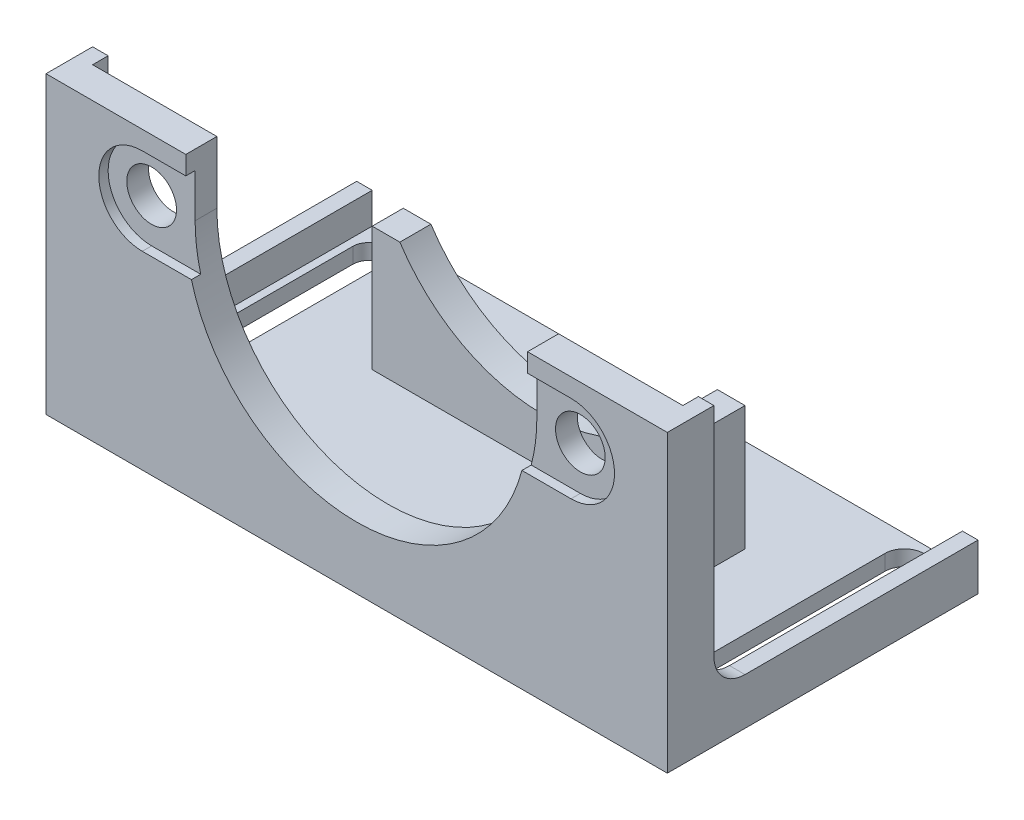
ISO-10303-21;
HEADER;
FILE_DESCRIPTION(('STEP AP214'),'2;1');
FILE_NAME('part.step','',(''),(''),'','','');
FILE_SCHEMA(('AUTOMOTIVE_DESIGN { 1 0 10303 214 1 1 1 1 }'));
ENDSEC;
DATA;
#1=APPLICATION_CONTEXT('core data for automotive mechanical design processes');
#2=APPLICATION_PROTOCOL_DEFINITION('international standard','automotive_design',2000,#1);
#3=PRODUCT_CONTEXT('',#1,'mechanical');
#4=PRODUCT('Part','Part','',(#3));
#5=PRODUCT_RELATED_PRODUCT_CATEGORY('part','',(#4));
#6=PRODUCT_DEFINITION_FORMATION('','',#4);
#7=PRODUCT_DEFINITION_CONTEXT('part definition',#1,'design');
#8=PRODUCT_DEFINITION('design','',#6,#7);
#9=PRODUCT_DEFINITION_SHAPE('','',#8);
#10=(LENGTH_UNIT() NAMED_UNIT(*) SI_UNIT(.MILLI.,.METRE.));
#11=(NAMED_UNIT(*) PLANE_ANGLE_UNIT() SI_UNIT($,.RADIAN.));
#12=(NAMED_UNIT(*) SI_UNIT($,.STERADIAN.) SOLID_ANGLE_UNIT());
#13=UNCERTAINTY_MEASURE_WITH_UNIT(LENGTH_MEASURE(1.E-05),#10,'distance_accuracy_value','');
#14=(GEOMETRIC_REPRESENTATION_CONTEXT(3) GLOBAL_UNCERTAINTY_ASSIGNED_CONTEXT((#13)) GLOBAL_UNIT_ASSIGNED_CONTEXT((#10,
#11,#12)) REPRESENTATION_CONTEXT('',''));
#15=CARTESIAN_POINT('',(0.,0.,0.));
#16=DIRECTION('',(0.,0.,1.));
#17=DIRECTION('',(1.,0.,0.));
#18=AXIS2_PLACEMENT_3D('',#15,#16,#17);
#19=CARTESIAN_POINT('',(0.,11.43,0.));
#20=DIRECTION('',(0.,1.,0.));
#21=DIRECTION('',(0.,0.,1.));
#22=AXIS2_PLACEMENT_3D('',#19,#20,#21);
#23=PLANE('',#22);
#24=DIRECTION('',(0.,0.,1.));
#25=VECTOR('',#24,1.);
#26=CARTESIAN_POINT('',(13.691178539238,11.43,0.));
#27=LINE('',#26,#25);
#28=CARTESIAN_POINT('',(13.691178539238,11.43,7.62));
#29=VERTEX_POINT('',#28);
#30=CARTESIAN_POINT('',(13.691178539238,11.43,10.16));
#31=VERTEX_POINT('',#30);
#32=EDGE_CURVE('E576',#29,#31,#27,.T.);
#33=ORIENTED_EDGE('',*,*,#32,.F.);
#34=DIRECTION('',(-1.,0.,0.));
#35=VECTOR('',#34,1.);
#36=CARTESIAN_POINT('',(11.43,11.43,7.62));
#37=LINE('',#36,#35);
#38=CARTESIAN_POINT('',(11.43,11.43,7.62));
#39=VERTEX_POINT('',#38);
#40=EDGE_CURVE('E398',#29,#39,#37,.T.);
#41=ORIENTED_EDGE('',*,*,#40,.T.);
#42=DIRECTION('',(0.,0.,1.));
#43=VECTOR('',#42,1.);
#44=CARTESIAN_POINT('',(11.43,11.43,7.62));
#45=LINE('',#44,#43);
#46=CARTESIAN_POINT('',(11.43,11.43,10.16));
#47=VERTEX_POINT('',#46);
#48=EDGE_CURVE('E388',#39,#47,#45,.T.);
#49=ORIENTED_EDGE('',*,*,#48,.T.);
#50=DIRECTION('',(1.,0.,0.));
#51=VECTOR('',#50,1.);
#52=CARTESIAN_POINT('',(11.43,11.43,10.16));
#53=LINE('',#52,#51);
#54=EDGE_CURVE('E393',#47,#31,#53,.T.);
#55=ORIENTED_EDGE('',*,*,#54,.T.);
#56=EDGE_LOOP('',(#33,#41,#49,#55));
#57=FACE_BOUND('',#56,.T.);
#58=ADVANCED_FACE('F36',(#57),#23,.T.);
#59=CARTESIAN_POINT('',(0.,1.27,25.4));
#60=DIRECTION('',(0.,1.,0.));
#61=DIRECTION('',(0.,0.,1.));
#62=AXIS2_PLACEMENT_3D('',#59,#60,#61);
#63=PLANE('',#62);
#64=CARTESIAN_POINT('',(3.175,1.27,2.2156355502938));
#65=DIRECTION('',(0.,1.,0.));
#66=DIRECTION('',(0.,0.,1.));
#67=AXIS2_PLACEMENT_3D('',#64,#65,#66);
#68=CIRCLE('',#67,1.27);
#69=CARTESIAN_POINT('',(4.445,1.27,2.2156355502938));
#70=VERTEX_POINT('',#69);
#71=CARTESIAN_POINT('',(1.905,1.27,2.2156355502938));
#72=VERTEX_POINT('',#71);
#73=EDGE_CURVE('E51',#70,#72,#68,.T.);
#74=ORIENTED_EDGE('',*,*,#73,.F.);
#75=DIRECTION('',(0.,0.,-1.));
#76=VECTOR('',#75,1.);
#77=CARTESIAN_POINT('',(4.445,1.27,2.2156355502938));
#78=LINE('',#77,#76);
#79=CARTESIAN_POINT('',(4.445,1.27,19.9956355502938));
#80=VERTEX_POINT('',#79);
#81=EDGE_CURVE('E313',#80,#70,#78,.T.);
#82=ORIENTED_EDGE('',*,*,#81,.F.);
#83=CARTESIAN_POINT('',(3.175,1.27,19.9956355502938));
#84=DIRECTION('',(0.,1.,0.));
#85=DIRECTION('',(0.,0.,1.));
#86=AXIS2_PLACEMENT_3D('',#83,#84,#85);
#87=CIRCLE('',#86,1.27);
#88=CARTESIAN_POINT('',(1.905,1.27,19.9956355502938));
#89=VERTEX_POINT('',#88);
#90=EDGE_CURVE('E316',#89,#80,#87,.T.);
#91=ORIENTED_EDGE('',*,*,#90,.F.);
#92=DIRECTION('',(0.,0.,1.));
#93=VECTOR('',#92,1.);
#94=CARTESIAN_POINT('',(1.905,1.27,2.2156355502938));
#95=LINE('',#94,#93);
#96=EDGE_CURVE('E322',#72,#89,#95,.T.);
#97=ORIENTED_EDGE('',*,*,#96,.F.);
#98=EDGE_LOOP('',(#74,#82,#91,#97));
#99=FACE_BOUND('',#98,.T.);
#100=CARTESIAN_POINT('',(46.99,1.27,2.2156355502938));
#101=DIRECTION('',(0.,1.,0.));
#102=DIRECTION('',(0.,0.,1.));
#103=AXIS2_PLACEMENT_3D('',#100,#101,#102);
#104=CIRCLE('',#103,1.5875);
#105=CARTESIAN_POINT('',(48.5775,1.27,2.2156355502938));
#106=VERTEX_POINT('',#105);
#107=CARTESIAN_POINT('',(45.4025,1.27,2.2156355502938));
#108=VERTEX_POINT('',#107);
#109=EDGE_CURVE('E59',#106,#108,#104,.T.);
#110=ORIENTED_EDGE('',*,*,#109,.F.);
#111=DIRECTION('',(0.,0.,-1.));
#112=VECTOR('',#111,1.);
#113=CARTESIAN_POINT('',(48.5775,1.27,2.2156355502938));
#114=LINE('',#113,#112);
#115=CARTESIAN_POINT('',(48.5775,1.27,19.9956355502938));
#116=VERTEX_POINT('',#115);
#117=EDGE_CURVE('E337',#116,#106,#114,.T.);
#118=ORIENTED_EDGE('',*,*,#117,.F.);
#119=CARTESIAN_POINT('',(46.99,1.27,19.9956355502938));
#120=DIRECTION('',(0.,1.,0.));
#121=DIRECTION('',(0.,0.,1.));
#122=AXIS2_PLACEMENT_3D('',#119,#120,#121);
#123=CIRCLE('',#122,1.5875);
#124=CARTESIAN_POINT('',(45.4025,1.27,19.9956355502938));
#125=VERTEX_POINT('',#124);
#126=EDGE_CURVE('E351',#125,#116,#123,.T.);
#127=ORIENTED_EDGE('',*,*,#126,.F.);
#128=DIRECTION('',(0.,0.,1.));
#129=VECTOR('',#128,1.);
#130=CARTESIAN_POINT('',(45.4025,1.27,2.2156355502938));
#131=LINE('',#130,#129);
#132=EDGE_CURVE('E348',#108,#125,#131,.T.);
#133=ORIENTED_EDGE('',*,*,#132,.F.);
#134=EDGE_LOOP('',(#110,#118,#127,#133));
#135=FACE_BOUND('',#134,.T.);
#136=DIRECTION('',(0.,0.,-1.));
#137=VECTOR('',#136,1.);
#138=CARTESIAN_POINT('',(1.27,1.27,-1.63768401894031));
#139=LINE('',#138,#137);
#140=CARTESIAN_POINT('',(1.27,1.27,22.86));
#141=VERTEX_POINT('',#140);
#142=CARTESIAN_POINT('',(1.27,1.27,0.));
#143=VERTEX_POINT('',#142);
#144=EDGE_CURVE('E472',#141,#143,#139,.T.);
#145=ORIENTED_EDGE('',*,*,#144,.F.);
#146=DIRECTION('',(-1.,0.,0.));
#147=VECTOR('',#146,1.);
#148=CARTESIAN_POINT('',(1.27,1.27,22.86));
#149=LINE('',#148,#147);
#150=CARTESIAN_POINT('',(49.53,1.27,22.86));
#151=VERTEX_POINT('',#150);
#152=EDGE_CURVE('E476',#151,#141,#149,.T.);
#153=ORIENTED_EDGE('',*,*,#152,.F.);
#154=DIRECTION('',(0.,0.,1.));
#155=VECTOR('',#154,1.);
#156=CARTESIAN_POINT('',(49.53,1.27,-1.63768401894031));
#157=LINE('',#156,#155);
#158=CARTESIAN_POINT('',(49.53,1.27,0.));
#159=VERTEX_POINT('',#158);
#160=EDGE_CURVE('E470',#159,#151,#157,.T.);
#161=ORIENTED_EDGE('',*,*,#160,.F.);
#162=DIRECTION('',(1.,0.,0.));
#163=VECTOR('',#162,1.);
#164=CARTESIAN_POINT('',(0.,1.27,0.));
#165=LINE('',#164,#163);
#166=EDGE_CURVE('E553',#143,#159,#165,.T.);
#167=ORIENTED_EDGE('',*,*,#166,.F.);
#168=EDGE_LOOP('',(#145,#153,#161,#167));
#169=FACE_BOUND('',#168,.T.);
#170=DIRECTION('',(1.,0.,0.));
#171=VECTOR('',#170,1.);
#172=CARTESIAN_POINT('',(11.43,1.27,10.16));
#173=LINE('',#172,#171);
#174=CARTESIAN_POINT('',(11.43,1.27,10.16));
#175=VERTEX_POINT('',#174);
#176=CARTESIAN_POINT('',(39.37,1.27,10.16));
#177=VERTEX_POINT('',#176);
#178=EDGE_CURVE('E405',#175,#177,#173,.T.);
#179=ORIENTED_EDGE('',*,*,#178,.F.);
#180=DIRECTION('',(0.,0.,1.));
#181=VECTOR('',#180,1.);
#182=CARTESIAN_POINT('',(11.43,1.27,7.62));
#183=LINE('',#182,#181);
#184=CARTESIAN_POINT('',(11.43,1.27,7.62));
#185=VERTEX_POINT('',#184);
#186=EDGE_CURVE('E387',#185,#175,#183,.T.);
#187=ORIENTED_EDGE('',*,*,#186,.F.);
#188=DIRECTION('',(-1.,0.,0.));
#189=VECTOR('',#188,1.);
#190=CARTESIAN_POINT('',(11.43,1.27,7.62));
#191=LINE('',#190,#189);
#192=CARTESIAN_POINT('',(39.37,1.27,7.62));
#193=VERTEX_POINT('',#192);
#194=EDGE_CURVE('E392',#193,#185,#191,.T.);
#195=ORIENTED_EDGE('',*,*,#194,.F.);
#196=DIRECTION('',(0.,0.,-1.));
#197=VECTOR('',#196,1.);
#198=CARTESIAN_POINT('',(39.37,1.27,7.62));
#199=LINE('',#198,#197);
#200=EDGE_CURVE('E407',#177,#193,#199,.T.);
#201=ORIENTED_EDGE('',*,*,#200,.F.);
#202=EDGE_LOOP('',(#179,#187,#195,#201));
#203=FACE_BOUND('',#202,.T.);
#204=ADVANCED_FACE('F628',(#99,#135,#169,#203),#63,.T.);
#205=CARTESIAN_POINT('',(42.926,19.05,0.));
#206=DIRECTION('',(0.,0.,1.));
#207=DIRECTION('',(1.,0.,0.));
#208=AXIS2_PLACEMENT_3D('',#205,#206,#207);
#209=CYLINDRICAL_SURFACE('',#208,2.032);
#210=CARTESIAN_POINT('',(42.926,19.05,22.86));
#211=DIRECTION('',(0.,0.,1.));
#212=DIRECTION('',(1.,0.,0.));
#213=AXIS2_PLACEMENT_3D('',#210,#211,#212);
#214=CIRCLE('',#213,2.032);
#215=CARTESIAN_POINT('',(44.958,19.05,22.86));
#216=VERTEX_POINT('',#215);
#217=EDGE_CURVE('E491',#216,#216,#214,.F.);
#218=ORIENTED_EDGE('',*,*,#217,.T.);
#219=EDGE_LOOP('',(#218));
#220=FACE_BOUND('',#219,.T.);
#221=CARTESIAN_POINT('',(42.926,19.05,24.638));
#222=DIRECTION('',(0.,0.,1.));
#223=DIRECTION('',(1.,0.,0.));
#224=AXIS2_PLACEMENT_3D('',#221,#222,#223);
#225=CIRCLE('',#224,2.032);
#226=CARTESIAN_POINT('',(44.958,19.05,24.638));
#227=VERTEX_POINT('',#226);
#228=EDGE_CURVE('E456',#227,#227,#225,.F.);
#229=ORIENTED_EDGE('',*,*,#228,.F.);
#230=EDGE_LOOP('',(#229));
#231=FACE_BOUND('',#230,.T.);
#232=ADVANCED_FACE('F737',(#220,#231),#209,.F.);
#233=CARTESIAN_POINT('',(7.87400000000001,19.05,0.));
#234=DIRECTION('',(0.,0.,1.));
#235=DIRECTION('',(1.,0.,0.));
#236=AXIS2_PLACEMENT_3D('',#233,#234,#235);
#237=CYLINDRICAL_SURFACE('',#236,2.032);
#238=CARTESIAN_POINT('',(7.87400000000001,19.05,22.86));
#239=DIRECTION('',(0.,0.,1.));
#240=DIRECTION('',(1.,0.,0.));
#241=AXIS2_PLACEMENT_3D('',#238,#239,#240);
#242=CIRCLE('',#241,2.032);
#243=CARTESIAN_POINT('',(9.90600000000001,19.05,22.86));
#244=VERTEX_POINT('',#243);
#245=EDGE_CURVE('E490',#244,#244,#242,.F.);
#246=ORIENTED_EDGE('',*,*,#245,.T.);
#247=EDGE_LOOP('',(#246));
#248=FACE_BOUND('',#247,.T.);
#249=CARTESIAN_POINT('',(7.87400000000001,19.05,24.638));
#250=DIRECTION('',(0.,0.,1.));
#251=DIRECTION('',(1.,0.,0.));
#252=AXIS2_PLACEMENT_3D('',#249,#250,#251);
#253=CIRCLE('',#252,2.032);
#254=CARTESIAN_POINT('',(9.90600000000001,19.05,24.638));
#255=VERTEX_POINT('',#254);
#256=EDGE_CURVE('E449',#255,#255,#253,.F.);
#257=ORIENTED_EDGE('',*,*,#256,.F.);
#258=EDGE_LOOP('',(#257));
#259=FACE_BOUND('',#258,.T.);
#260=ADVANCED_FACE('F815',(#248,#259),#237,.F.);
#261=CARTESIAN_POINT('',(0.,24.13,25.4));
#262=DIRECTION('',(0.,-1.,0.));
#263=DIRECTION('',(0.,0.,-1.));
#264=AXIS2_PLACEMENT_3D('',#261,#262,#263);
#265=PLANE('',#264);
#266=DIRECTION('',(0.,0.,1.));
#267=VECTOR('',#266,1.);
#268=CARTESIAN_POINT('',(1.27,24.13,-1.63768401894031));
#269=LINE('',#268,#267);
#270=CARTESIAN_POINT('',(1.27,24.13,21.59));
#271=VERTEX_POINT('',#270);
#272=CARTESIAN_POINT('',(1.27,24.13,22.86));
#273=VERTEX_POINT('',#272);
#274=EDGE_CURVE('E469',#271,#273,#269,.T.);
#275=ORIENTED_EDGE('',*,*,#274,.F.);
#276=DIRECTION('',(-1.,0.,0.));
#277=VECTOR('',#276,1.);
#278=CARTESIAN_POINT('',(0.,24.13,21.59));
#279=LINE('',#278,#277);
#280=CARTESIAN_POINT('',(0.,24.13,21.59));
#281=VERTEX_POINT('',#280);
#282=EDGE_CURVE('E379',#271,#281,#279,.T.);
#283=ORIENTED_EDGE('',*,*,#282,.T.);
#284=DIRECTION('',(0.,0.,-1.));
#285=VECTOR('',#284,1.);
#286=CARTESIAN_POINT('',(0.,24.13,25.4));
#287=LINE('',#286,#285);
#288=CARTESIAN_POINT('',(0.,24.13,25.4));
#289=VERTEX_POINT('',#288);
#290=EDGE_CURVE('E536',#289,#281,#287,.T.);
#291=ORIENTED_EDGE('',*,*,#290,.F.);
#292=DIRECTION('',(-1.,0.,0.));
#293=VECTOR('',#292,1.);
#294=CARTESIAN_POINT('',(0.,24.13,25.4));
#295=LINE('',#294,#293);
#296=CARTESIAN_POINT('',(11.43,24.13,25.4));
#297=VERTEX_POINT('',#296);
#298=EDGE_CURVE('E532',#297,#289,#295,.T.);
#299=ORIENTED_EDGE('',*,*,#298,.F.);
#300=DIRECTION('',(0.,0.,-1.));
#301=VECTOR('',#300,1.);
#302=CARTESIAN_POINT('',(11.43,24.13,25.4));
#303=LINE('',#302,#301);
#304=CARTESIAN_POINT('',(11.43,24.13,22.86));
#305=VERTEX_POINT('',#304);
#306=EDGE_CURVE('E520',#297,#305,#303,.T.);
#307=ORIENTED_EDGE('',*,*,#306,.T.);
#308=DIRECTION('',(1.,0.,0.));
#309=VECTOR('',#308,1.);
#310=CARTESIAN_POINT('',(1.27,24.13,22.86));
#311=LINE('',#310,#309);
#312=EDGE_CURVE('E479',#273,#305,#311,.T.);
#313=ORIENTED_EDGE('',*,*,#312,.F.);
#314=EDGE_LOOP('',(#275,#283,#291,#299,#307,#313));
#315=FACE_BOUND('',#314,.T.);
#316=ADVANCED_FACE('F671',(#315),#265,.F.);
#317=CARTESIAN_POINT('',(0.,0.,25.4));
#318=DIRECTION('',(1.,0.,0.));
#319=DIRECTION('',(0.,0.,-1.));
#320=AXIS2_PLACEMENT_3D('',#317,#318,#319);
#321=PLANE('',#320);
#322=ORIENTED_EDGE('',*,*,#290,.T.);
#323=DIRECTION('',(0.,1.,0.));
#324=VECTOR('',#323,1.);
#325=CARTESIAN_POINT('',(0.,40.5957158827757,21.59));
#326=LINE('',#325,#324);
#327=CARTESIAN_POINT('',(0.,6.35,21.59));
#328=VERTEX_POINT('',#327);
#329=EDGE_CURVE('E372',#328,#281,#326,.T.);
#330=ORIENTED_EDGE('',*,*,#329,.F.);
#331=CARTESIAN_POINT('',(0.,6.35,19.05));
#332=DIRECTION('',(1.,0.,0.));
#333=DIRECTION('',(0.,0.,-1.));
#334=AXIS2_PLACEMENT_3D('',#331,#332,#333);
#335=CIRCLE('',#334,2.54);
#336=CARTESIAN_POINT('',(0.,3.81,19.05));
#337=VERTEX_POINT('',#336);
#338=EDGE_CURVE('E598',#328,#337,#335,.T.);
#339=ORIENTED_EDGE('',*,*,#338,.T.);
#340=DIRECTION('',(0.,0.,1.));
#341=VECTOR('',#340,1.);
#342=CARTESIAN_POINT('',(0.,3.81,21.59));
#343=LINE('',#342,#341);
#344=CARTESIAN_POINT('',(0.,3.81,0.));
#345=VERTEX_POINT('',#344);
#346=EDGE_CURVE('E374',#345,#337,#343,.T.);
#347=ORIENTED_EDGE('',*,*,#346,.F.);
#348=DIRECTION('',(0.,-1.,0.));
#349=VECTOR('',#348,1.);
#350=CARTESIAN_POINT('',(0.,0.,0.));
#351=LINE('',#350,#349);
#352=CARTESIAN_POINT('',(0.,0.,0.));
#353=VERTEX_POINT('',#352);
#354=EDGE_CURVE('E523',#345,#353,#351,.T.);
#355=ORIENTED_EDGE('',*,*,#354,.T.);
#356=DIRECTION('',(0.,0.,-1.));
#357=VECTOR('',#356,1.);
#358=CARTESIAN_POINT('',(0.,0.,25.4));
#359=LINE('',#358,#357);
#360=CARTESIAN_POINT('',(0.,0.,25.4));
#361=VERTEX_POINT('',#360);
#362=EDGE_CURVE('E550',#361,#353,#359,.T.);
#363=ORIENTED_EDGE('',*,*,#362,.F.);
#364=DIRECTION('',(0.,-1.,0.));
#365=VECTOR('',#364,1.);
#366=CARTESIAN_POINT('',(0.,0.,25.4));
#367=LINE('',#366,#365);
#368=EDGE_CURVE('E524',#289,#361,#367,.T.);
#369=ORIENTED_EDGE('',*,*,#368,.F.);
#370=EDGE_LOOP('',(#322,#330,#339,#347,#355,#363,#369));
#371=FACE_BOUND('',#370,.T.);
#372=ADVANCED_FACE('F653',(#371),#321,.F.);
#373=CARTESIAN_POINT('',(0.,0.,25.4));
#374=DIRECTION('',(0.,1.,0.));
#375=DIRECTION('',(0.,0.,1.));
#376=AXIS2_PLACEMENT_3D('',#373,#374,#375);
#377=PLANE('',#376);
#378=DIRECTION('',(0.,0.,-1.));
#379=VECTOR('',#378,1.);
#380=CARTESIAN_POINT('',(4.445,0.,2.2156355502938));
#381=LINE('',#380,#379);
#382=CARTESIAN_POINT('',(4.445,0.,19.9956355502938));
#383=VERTEX_POINT('',#382);
#384=CARTESIAN_POINT('',(4.445,0.,2.2156355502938));
#385=VERTEX_POINT('',#384);
#386=EDGE_CURVE('E300',#383,#385,#381,.T.);
#387=ORIENTED_EDGE('',*,*,#386,.T.);
#388=CARTESIAN_POINT('',(3.175,0.,2.2156355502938));
#389=DIRECTION('',(0.,1.,0.));
#390=DIRECTION('',(0.,0.,1.));
#391=AXIS2_PLACEMENT_3D('',#388,#389,#390);
#392=CIRCLE('',#391,1.27);
#393=CARTESIAN_POINT('',(1.905,0.,2.2156355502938));
#394=VERTEX_POINT('',#393);
#395=EDGE_CURVE('E294',#385,#394,#392,.T.);
#396=ORIENTED_EDGE('',*,*,#395,.T.);
#397=DIRECTION('',(0.,0.,1.));
#398=VECTOR('',#397,1.);
#399=CARTESIAN_POINT('',(1.905,0.,2.2156355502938));
#400=LINE('',#399,#398);
#401=CARTESIAN_POINT('',(1.905,0.,19.9956355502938));
#402=VERTEX_POINT('',#401);
#403=EDGE_CURVE('E304',#394,#402,#400,.T.);
#404=ORIENTED_EDGE('',*,*,#403,.T.);
#405=CARTESIAN_POINT('',(3.175,0.,19.9956355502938));
#406=DIRECTION('',(0.,1.,0.));
#407=DIRECTION('',(0.,0.,1.));
#408=AXIS2_PLACEMENT_3D('',#405,#406,#407);
#409=CIRCLE('',#408,1.27);
#410=EDGE_CURVE('E308',#402,#383,#409,.T.);
#411=ORIENTED_EDGE('',*,*,#410,.T.);
#412=EDGE_LOOP('',(#387,#396,#404,#411));
#413=FACE_BOUND('',#412,.T.);
#414=DIRECTION('',(0.,0.,-1.));
#415=VECTOR('',#414,1.);
#416=CARTESIAN_POINT('',(48.5775,0.,2.2156355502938));
#417=LINE('',#416,#415);
#418=CARTESIAN_POINT('',(48.5775,0.,19.9956355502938));
#419=VERTEX_POINT('',#418);
#420=CARTESIAN_POINT('',(48.5775,0.,2.2156355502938));
#421=VERTEX_POINT('',#420);
#422=EDGE_CURVE('E343',#419,#421,#417,.T.);
#423=ORIENTED_EDGE('',*,*,#422,.T.);
#424=CARTESIAN_POINT('',(46.99,0.,2.2156355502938));
#425=DIRECTION('',(0.,1.,0.));
#426=DIRECTION('',(0.,0.,1.));
#427=AXIS2_PLACEMENT_3D('',#424,#425,#426);
#428=CIRCLE('',#427,1.5875);
#429=CARTESIAN_POINT('',(45.4025,0.,2.2156355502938));
#430=VERTEX_POINT('',#429);
#431=EDGE_CURVE('E333',#421,#430,#428,.T.);
#432=ORIENTED_EDGE('',*,*,#431,.T.);
#433=DIRECTION('',(0.,0.,1.));
#434=VECTOR('',#433,1.);
#435=CARTESIAN_POINT('',(45.4025,0.,2.2156355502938));
#436=LINE('',#435,#434);
#437=CARTESIAN_POINT('',(45.4025,0.,19.9956355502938));
#438=VERTEX_POINT('',#437);
#439=EDGE_CURVE('E336',#430,#438,#436,.T.);
#440=ORIENTED_EDGE('',*,*,#439,.T.);
#441=CARTESIAN_POINT('',(46.99,0.,19.9956355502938));
#442=DIRECTION('',(0.,1.,0.));
#443=DIRECTION('',(0.,0.,1.));
#444=AXIS2_PLACEMENT_3D('',#441,#442,#443);
#445=CIRCLE('',#444,1.5875);
#446=EDGE_CURVE('E340',#438,#419,#445,.T.);
#447=ORIENTED_EDGE('',*,*,#446,.T.);
#448=EDGE_LOOP('',(#423,#432,#440,#447));
#449=FACE_BOUND('',#448,.T.);
#450=DIRECTION('',(1.,0.,0.));
#451=VECTOR('',#450,1.);
#452=CARTESIAN_POINT('',(0.,0.,0.));
#453=LINE('',#452,#451);
#454=CARTESIAN_POINT('',(50.8,0.,0.));
#455=VERTEX_POINT('',#454);
#456=EDGE_CURVE('E538',#353,#455,#453,.T.);
#457=ORIENTED_EDGE('',*,*,#456,.T.);
#458=DIRECTION('',(0.,0.,-1.));
#459=VECTOR('',#458,1.);
#460=CARTESIAN_POINT('',(50.8,0.,25.4));
#461=LINE('',#460,#459);
#462=CARTESIAN_POINT('',(50.8,0.,25.4));
#463=VERTEX_POINT('',#462);
#464=EDGE_CURVE('E547',#463,#455,#461,.T.);
#465=ORIENTED_EDGE('',*,*,#464,.F.);
#466=DIRECTION('',(1.,0.,0.));
#467=VECTOR('',#466,1.);
#468=CARTESIAN_POINT('',(0.,0.,25.4));
#469=LINE('',#468,#467);
#470=EDGE_CURVE('E527',#361,#463,#469,.T.);
#471=ORIENTED_EDGE('',*,*,#470,.F.);
#472=ORIENTED_EDGE('',*,*,#362,.T.);
#473=EDGE_LOOP('',(#457,#465,#471,#472));
#474=FACE_BOUND('',#473,.T.);
#475=ADVANCED_FACE('F310',(#413,#449,#474),#377,.F.);
#476=CARTESIAN_POINT('',(50.8,0.,25.4));
#477=DIRECTION('',(-1.,0.,0.));
#478=DIRECTION('',(0.,0.,1.));
#479=AXIS2_PLACEMENT_3D('',#476,#477,#478);
#480=PLANE('',#479);
#481=DIRECTION('',(0.,0.,-1.));
#482=VECTOR('',#481,1.);
#483=CARTESIAN_POINT('',(50.8,3.81,21.59));
#484=LINE('',#483,#482);
#485=CARTESIAN_POINT('',(50.8,3.81,19.05));
#486=VERTEX_POINT('',#485);
#487=CARTESIAN_POINT('',(50.8,3.81,0.));
#488=VERTEX_POINT('',#487);
#489=EDGE_CURVE('E364',#486,#488,#484,.T.);
#490=ORIENTED_EDGE('',*,*,#489,.F.);
#491=CARTESIAN_POINT('',(50.8,6.35,19.05));
#492=DIRECTION('',(-1.,0.,0.));
#493=DIRECTION('',(0.,0.,1.));
#494=AXIS2_PLACEMENT_3D('',#491,#492,#493);
#495=CIRCLE('',#494,2.54);
#496=CARTESIAN_POINT('',(50.8,6.35,21.59));
#497=VERTEX_POINT('',#496);
#498=EDGE_CURVE('E44',#486,#497,#495,.T.);
#499=ORIENTED_EDGE('',*,*,#498,.T.);
#500=DIRECTION('',(0.,-1.,0.));
#501=VECTOR('',#500,1.);
#502=CARTESIAN_POINT('',(50.8,32.8673341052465,21.59));
#503=LINE('',#502,#501);
#504=CARTESIAN_POINT('',(50.8,24.13,21.59));
#505=VERTEX_POINT('',#504);
#506=EDGE_CURVE('E329',#505,#497,#503,.T.);
#507=ORIENTED_EDGE('',*,*,#506,.F.);
#508=DIRECTION('',(0.,0.,-1.));
#509=VECTOR('',#508,1.);
#510=CARTESIAN_POINT('',(50.8,24.13,25.4));
#511=LINE('',#510,#509);
#512=CARTESIAN_POINT('',(50.8,24.13,25.4));
#513=VERTEX_POINT('',#512);
#514=EDGE_CURVE('E544',#513,#505,#511,.T.);
#515=ORIENTED_EDGE('',*,*,#514,.F.);
#516=DIRECTION('',(0.,1.,0.));
#517=VECTOR('',#516,1.);
#518=CARTESIAN_POINT('',(50.8,0.,25.4));
#519=LINE('',#518,#517);
#520=EDGE_CURVE('E530',#463,#513,#519,.T.);
#521=ORIENTED_EDGE('',*,*,#520,.F.);
#522=ORIENTED_EDGE('',*,*,#464,.T.);
#523=DIRECTION('',(0.,1.,0.));
#524=VECTOR('',#523,1.);
#525=CARTESIAN_POINT('',(50.8,0.,0.));
#526=LINE('',#525,#524);
#527=EDGE_CURVE('E528',#455,#488,#526,.T.);
#528=ORIENTED_EDGE('',*,*,#527,.T.);
#529=EDGE_LOOP('',(#490,#499,#507,#515,#521,#522,#528));
#530=FACE_BOUND('',#529,.T.);
#531=ADVANCED_FACE('F604',(#530),#480,.F.);
#532=ORIENTED_EDGE('',*,*,#514,.T.);
#533=DIRECTION('',(-1.,0.,0.));
#534=VECTOR('',#533,1.);
#535=CARTESIAN_POINT('',(0.,24.13,21.59));
#536=LINE('',#535,#534);
#537=CARTESIAN_POINT('',(49.53,24.13,21.59));
#538=VERTEX_POINT('',#537);
#539=EDGE_CURVE('E369',#505,#538,#536,.T.);
#540=ORIENTED_EDGE('',*,*,#539,.T.);
#541=DIRECTION('',(0.,0.,-1.));
#542=VECTOR('',#541,1.);
#543=CARTESIAN_POINT('',(49.53,24.13,-1.63768401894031));
#544=LINE('',#543,#542);
#545=CARTESIAN_POINT('',(49.53,24.13,22.86));
#546=VERTEX_POINT('',#545);
#547=EDGE_CURVE('E481',#546,#538,#544,.T.);
#548=ORIENTED_EDGE('',*,*,#547,.F.);
#549=CARTESIAN_POINT('',(39.37,24.13,22.86));
#550=VERTEX_POINT('',#549);
#551=EDGE_CURVE('E478',#550,#546,#311,.T.);
#552=ORIENTED_EDGE('',*,*,#551,.F.);
#553=DIRECTION('',(0.,0.,1.));
#554=VECTOR('',#553,1.);
#555=CARTESIAN_POINT('',(39.37,24.13,25.4));
#556=LINE('',#555,#554);
#557=CARTESIAN_POINT('',(39.37,24.13,25.4));
#558=VERTEX_POINT('',#557);
#559=EDGE_CURVE('E515',#550,#558,#556,.T.);
#560=ORIENTED_EDGE('',*,*,#559,.T.);
#561=EDGE_CURVE('E533',#513,#558,#295,.T.);
#562=ORIENTED_EDGE('',*,*,#561,.F.);
#563=EDGE_LOOP('',(#532,#540,#548,#552,#560,#562));
#564=FACE_BOUND('',#563,.T.);
#565=ADVANCED_FACE('F637',(#564),#265,.F.);
#566=CARTESIAN_POINT('',(0.,0.,25.4));
#567=DIRECTION('',(0.,0.,-1.));
#568=DIRECTION('',(-1.,0.,0.));
#569=AXIS2_PLACEMENT_3D('',#566,#567,#568);
#570=PLANE('',#569);
#571=DIRECTION('',(0.,1.,0.));
#572=VECTOR('',#571,1.);
#573=CARTESIAN_POINT('',(39.37,19.05,25.4));
#574=LINE('',#573,#572);
#575=CARTESIAN_POINT('',(39.37,22.606,25.4));
#576=VERTEX_POINT('',#575);
#577=EDGE_CURVE('E506',#576,#558,#574,.T.);
#578=ORIENTED_EDGE('',*,*,#577,.F.);
#579=DIRECTION('',(-1.,0.,0.));
#580=VECTOR('',#579,1.);
#581=CARTESIAN_POINT('',(7.87400000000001,22.606,25.4));
#582=LINE('',#581,#580);
#583=CARTESIAN_POINT('',(42.926,22.606,25.4));
#584=VERTEX_POINT('',#583);
#585=EDGE_CURVE('E425',#584,#576,#582,.T.);
#586=ORIENTED_EDGE('',*,*,#585,.F.);
#587=CARTESIAN_POINT('',(42.926,19.05,25.4));
#588=DIRECTION('',(0.,0.,1.));
#589=DIRECTION('',(1.,0.,0.));
#590=AXIS2_PLACEMENT_3D('',#587,#588,#589);
#591=CIRCLE('',#590,3.556);
#592=CARTESIAN_POINT('',(42.926,15.494,25.4));
#593=VERTEX_POINT('',#592);
#594=EDGE_CURVE('E441',#593,#584,#591,.T.);
#595=ORIENTED_EDGE('',*,*,#594,.F.);
#596=DIRECTION('',(1.,0.,0.));
#597=VECTOR('',#596,1.);
#598=CARTESIAN_POINT('',(7.87400000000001,15.494,25.4));
#599=LINE('',#598,#597);
#600=CARTESIAN_POINT('',(38.9098395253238,15.494,25.4));
#601=VERTEX_POINT('',#600);
#602=EDGE_CURVE('E438',#601,#593,#599,.T.);
#603=ORIENTED_EDGE('',*,*,#602,.F.);
#604=CARTESIAN_POINT('',(25.4,19.05,25.4));
#605=DIRECTION('',(0.,0.,1.));
#606=DIRECTION('',(1.,0.,0.));
#607=AXIS2_PLACEMENT_3D('',#604,#605,#606);
#608=CIRCLE('',#607,13.97);
#609=CARTESIAN_POINT('',(11.8901604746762,15.494,25.4));
#610=VERTEX_POINT('',#609);
#611=EDGE_CURVE('E503',#610,#601,#608,.T.);
#612=ORIENTED_EDGE('',*,*,#611,.F.);
#613=CARTESIAN_POINT('',(7.87400000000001,15.494,25.4));
#614=VERTEX_POINT('',#613);
#615=EDGE_CURVE('E439',#614,#610,#599,.T.);
#616=ORIENTED_EDGE('',*,*,#615,.F.);
#617=CARTESIAN_POINT('',(7.87400000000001,19.05,25.4));
#618=DIRECTION('',(0.,0.,1.));
#619=DIRECTION('',(1.,0.,0.));
#620=AXIS2_PLACEMENT_3D('',#617,#618,#619);
#621=CIRCLE('',#620,3.556);
#622=CARTESIAN_POINT('',(7.87400000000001,22.606,25.4));
#623=VERTEX_POINT('',#622);
#624=EDGE_CURVE('E420',#623,#614,#621,.T.);
#625=ORIENTED_EDGE('',*,*,#624,.F.);
#626=CARTESIAN_POINT('',(11.43,22.606,25.4));
#627=VERTEX_POINT('',#626);
#628=EDGE_CURVE('E444',#627,#623,#582,.T.);
#629=ORIENTED_EDGE('',*,*,#628,.F.);
#630=DIRECTION('',(0.,-1.,0.));
#631=VECTOR('',#630,1.);
#632=CARTESIAN_POINT('',(11.43,19.05,25.4));
#633=LINE('',#632,#631);
#634=EDGE_CURVE('E508',#297,#627,#633,.T.);
#635=ORIENTED_EDGE('',*,*,#634,.F.);
#636=ORIENTED_EDGE('',*,*,#298,.T.);
#637=ORIENTED_EDGE('',*,*,#368,.T.);
#638=ORIENTED_EDGE('',*,*,#470,.T.);
#639=ORIENTED_EDGE('',*,*,#520,.T.);
#640=ORIENTED_EDGE('',*,*,#561,.T.);
#641=EDGE_LOOP('',(#578,#586,#595,#603,#612,#616,#625,#629,#635,#636,#637,#638,#639,#640));
#642=FACE_BOUND('',#641,.T.);
#643=ADVANCED_FACE('F644',(#642),#570,.F.);
#644=CARTESIAN_POINT('',(0.,0.,0.));
#645=DIRECTION('',(0.,0.,-1.));
#646=DIRECTION('',(-1.,0.,0.));
#647=AXIS2_PLACEMENT_3D('',#644,#645,#646);
#648=PLANE('',#647);
#649=DIRECTION('',(-1.,0.,0.));
#650=VECTOR('',#649,1.);
#651=CARTESIAN_POINT('',(0.,3.81,0.));
#652=LINE('',#651,#650);
#653=CARTESIAN_POINT('',(49.53,3.81,0.));
#654=VERTEX_POINT('',#653);
#655=EDGE_CURVE('E366',#488,#654,#652,.T.);
#656=ORIENTED_EDGE('',*,*,#655,.F.);
#657=ORIENTED_EDGE('',*,*,#527,.F.);
#658=ORIENTED_EDGE('',*,*,#456,.F.);
#659=ORIENTED_EDGE('',*,*,#354,.F.);
#660=DIRECTION('',(-1.,0.,0.));
#661=VECTOR('',#660,1.);
#662=CARTESIAN_POINT('',(0.,3.81,0.));
#663=LINE('',#662,#661);
#664=CARTESIAN_POINT('',(1.27,3.81,0.));
#665=VERTEX_POINT('',#664);
#666=EDGE_CURVE('E377',#665,#345,#663,.T.);
#667=ORIENTED_EDGE('',*,*,#666,.F.);
#668=DIRECTION('',(0.,1.,0.));
#669=VECTOR('',#668,1.);
#670=CARTESIAN_POINT('',(1.27,0.,0.));
#671=LINE('',#670,#669);
#672=EDGE_CURVE('E560',#143,#665,#671,.T.);
#673=ORIENTED_EDGE('',*,*,#672,.F.);
#674=ORIENTED_EDGE('',*,*,#166,.T.);
#675=DIRECTION('',(0.,-1.,0.));
#676=VECTOR('',#675,1.);
#677=CARTESIAN_POINT('',(49.53,0.,0.));
#678=LINE('',#677,#676);
#679=EDGE_CURVE('E558',#654,#159,#678,.T.);
#680=ORIENTED_EDGE('',*,*,#679,.F.);
#681=EDGE_LOOP('',(#656,#657,#658,#659,#667,#673,#674,#680));
#682=FACE_BOUND('',#681,.T.);
#683=ADVANCED_FACE('F621',(#682),#648,.T.);
#684=CARTESIAN_POINT('',(11.43,19.05,0.));
#685=DIRECTION('',(-1.,0.,0.));
#686=DIRECTION('',(0.,0.,1.));
#687=AXIS2_PLACEMENT_3D('',#684,#685,#686);
#688=PLANE('',#687);
#689=ORIENTED_EDGE('',*,*,#634,.T.);
#690=DIRECTION('',(0.,0.,-1.));
#691=VECTOR('',#690,1.);
#692=CARTESIAN_POINT('',(11.43,22.606,0.));
#693=LINE('',#692,#691);
#694=CARTESIAN_POINT('',(11.43,22.606,24.638));
#695=VERTEX_POINT('',#694);
#696=EDGE_CURVE('E466',#627,#695,#693,.T.);
#697=ORIENTED_EDGE('',*,*,#696,.T.);
#698=DIRECTION('',(0.,1.,0.));
#699=VECTOR('',#698,1.);
#700=CARTESIAN_POINT('',(11.43,19.05,24.638));
#701=LINE('',#700,#699);
#702=CARTESIAN_POINT('',(11.43,19.05,24.638));
#703=VERTEX_POINT('',#702);
#704=EDGE_CURVE('E464',#703,#695,#701,.T.);
#705=ORIENTED_EDGE('',*,*,#704,.F.);
#706=DIRECTION('',(0.,0.,1.));
#707=VECTOR('',#706,1.);
#708=CARTESIAN_POINT('',(11.43,19.05,0.));
#709=LINE('',#708,#707);
#710=CARTESIAN_POINT('',(11.43,19.05,22.86));
#711=VERTEX_POINT('',#710);
#712=EDGE_CURVE('E512',#711,#703,#709,.T.);
#713=ORIENTED_EDGE('',*,*,#712,.F.);
#714=DIRECTION('',(0.,1.,0.));
#715=VECTOR('',#714,1.);
#716=CARTESIAN_POINT('',(11.43,19.05,22.86));
#717=LINE('',#716,#715);
#718=EDGE_CURVE('E500',#711,#305,#717,.T.);
#719=ORIENTED_EDGE('',*,*,#718,.T.);
#720=ORIENTED_EDGE('',*,*,#306,.F.);
#721=EDGE_LOOP('',(#689,#697,#705,#713,#719,#720));
#722=FACE_BOUND('',#721,.T.);
#723=ADVANCED_FACE('F675',(#722),#688,.F.);
#724=CARTESIAN_POINT('',(39.37,19.05,0.));
#725=DIRECTION('',(1.,0.,0.));
#726=DIRECTION('',(0.,0.,-1.));
#727=AXIS2_PLACEMENT_3D('',#724,#725,#726);
#728=PLANE('',#727);
#729=DIRECTION('',(0.,-1.,0.));
#730=VECTOR('',#729,1.);
#731=CARTESIAN_POINT('',(39.37,19.05,24.638));
#732=LINE('',#731,#730);
#733=CARTESIAN_POINT('',(39.37,22.606,24.638));
#734=VERTEX_POINT('',#733);
#735=CARTESIAN_POINT('',(39.37,19.05,24.638));
#736=VERTEX_POINT('',#735);
#737=EDGE_CURVE('E461',#734,#736,#732,.T.);
#738=ORIENTED_EDGE('',*,*,#737,.F.);
#739=DIRECTION('',(0.,0.,1.));
#740=VECTOR('',#739,1.);
#741=CARTESIAN_POINT('',(39.37,22.606,0.));
#742=LINE('',#741,#740);
#743=EDGE_CURVE('E571',#734,#576,#742,.T.);
#744=ORIENTED_EDGE('',*,*,#743,.T.);
#745=ORIENTED_EDGE('',*,*,#577,.T.);
#746=ORIENTED_EDGE('',*,*,#559,.F.);
#747=DIRECTION('',(0.,-1.,0.));
#748=VECTOR('',#747,1.);
#749=CARTESIAN_POINT('',(39.37,19.05,22.86));
#750=LINE('',#749,#748);
#751=CARTESIAN_POINT('',(39.37,19.05,22.86));
#752=VERTEX_POINT('',#751);
#753=EDGE_CURVE('E497',#550,#752,#750,.T.);
#754=ORIENTED_EDGE('',*,*,#753,.T.);
#755=DIRECTION('',(0.,0.,1.));
#756=VECTOR('',#755,1.);
#757=CARTESIAN_POINT('',(39.37,19.05,0.));
#758=LINE('',#757,#756);
#759=EDGE_CURVE('E511',#752,#736,#758,.T.);
#760=ORIENTED_EDGE('',*,*,#759,.T.);
#761=EDGE_LOOP('',(#738,#744,#745,#746,#754,#760));
#762=FACE_BOUND('',#761,.T.);
#763=ADVANCED_FACE('F685',(#762),#728,.F.);
#764=CARTESIAN_POINT('',(25.4,19.05,0.));
#765=DIRECTION('',(0.,0.,1.));
#766=DIRECTION('',(1.,0.,0.));
#767=AXIS2_PLACEMENT_3D('',#764,#765,#766);
#768=CYLINDRICAL_SURFACE('',#767,13.97);
#769=CARTESIAN_POINT('',(25.4,19.05,24.638));
#770=DIRECTION('',(0.,0.,1.));
#771=DIRECTION('',(1.,0.,0.));
#772=AXIS2_PLACEMENT_3D('',#769,#770,#771);
#773=CIRCLE('',#772,13.97);
#774=CARTESIAN_POINT('',(11.8901604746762,15.494,24.638));
#775=VERTEX_POINT('',#774);
#776=EDGE_CURVE('E462',#775,#703,#773,.F.);
#777=ORIENTED_EDGE('',*,*,#776,.F.);
#778=DIRECTION('',(0.,0.,1.));
#779=VECTOR('',#778,1.);
#780=CARTESIAN_POINT('',(11.8901604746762,15.494,0.));
#781=LINE('',#780,#779);
#782=EDGE_CURVE('E568',#775,#610,#781,.T.);
#783=ORIENTED_EDGE('',*,*,#782,.T.);
#784=ORIENTED_EDGE('',*,*,#611,.T.);
#785=DIRECTION('',(0.,0.,1.));
#786=VECTOR('',#785,1.);
#787=CARTESIAN_POINT('',(38.9098395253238,15.494,0.));
#788=LINE('',#787,#786);
#789=CARTESIAN_POINT('',(38.9098395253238,15.494,24.638));
#790=VERTEX_POINT('',#789);
#791=EDGE_CURVE('E563',#601,#790,#788,.F.);
#792=ORIENTED_EDGE('',*,*,#791,.T.);
#793=EDGE_CURVE('E459',#736,#790,#773,.F.);
#794=ORIENTED_EDGE('',*,*,#793,.F.);
#795=ORIENTED_EDGE('',*,*,#759,.F.);
#796=CARTESIAN_POINT('',(25.4,19.05,22.86));
#797=DIRECTION('',(0.,0.,1.));
#798=DIRECTION('',(1.,0.,0.));
#799=AXIS2_PLACEMENT_3D('',#796,#797,#798);
#800=CIRCLE('',#799,13.97);
#801=EDGE_CURVE('E494',#752,#711,#800,.F.);
#802=ORIENTED_EDGE('',*,*,#801,.T.);
#803=ORIENTED_EDGE('',*,*,#712,.T.);
#804=EDGE_LOOP('',(#777,#783,#784,#792,#794,#795,#802,#803));
#805=FACE_BOUND('',#804,.T.);
#806=ADVANCED_FACE('F680',(#805),#768,.F.);
#807=CARTESIAN_POINT('',(1.27,-54.1217527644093,22.86));
#808=DIRECTION('',(0.,0.,1.));
#809=DIRECTION('',(1.,0.,0.));
#810=AXIS2_PLACEMENT_3D('',#807,#808,#809);
#811=PLANE('',#810);
#812=ORIENTED_EDGE('',*,*,#245,.F.);
#813=EDGE_LOOP('',(#812));
#814=FACE_BOUND('',#813,.T.);
#815=ORIENTED_EDGE('',*,*,#217,.F.);
#816=EDGE_LOOP('',(#815));
#817=FACE_BOUND('',#816,.T.);
#818=ORIENTED_EDGE('',*,*,#801,.F.);
#819=ORIENTED_EDGE('',*,*,#753,.F.);
#820=ORIENTED_EDGE('',*,*,#551,.T.);
#821=DIRECTION('',(0.,1.,0.));
#822=VECTOR('',#821,1.);
#823=CARTESIAN_POINT('',(49.53,-54.1217527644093,22.86));
#824=LINE('',#823,#822);
#825=EDGE_CURVE('E473',#151,#546,#824,.T.);
#826=ORIENTED_EDGE('',*,*,#825,.F.);
#827=ORIENTED_EDGE('',*,*,#152,.T.);
#828=DIRECTION('',(0.,1.,0.));
#829=VECTOR('',#828,1.);
#830=CARTESIAN_POINT('',(1.27,-54.1217527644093,22.86));
#831=LINE('',#830,#829);
#832=EDGE_CURVE('E484',#141,#273,#831,.T.);
#833=ORIENTED_EDGE('',*,*,#832,.T.);
#834=ORIENTED_EDGE('',*,*,#312,.T.);
#835=ORIENTED_EDGE('',*,*,#718,.F.);
#836=EDGE_LOOP('',(#818,#819,#820,#826,#827,#833,#834,#835));
#837=FACE_BOUND('',#836,.T.);
#838=ADVANCED_FACE('F632',(#814,#817,#837),#811,.F.);
#839=CARTESIAN_POINT('',(1.27,-54.1217527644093,-1.63768401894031));
#840=DIRECTION('',(-1.,0.,0.));
#841=DIRECTION('',(0.,0.,1.));
#842=AXIS2_PLACEMENT_3D('',#839,#840,#841);
#843=PLANE('',#842);
#844=DIRECTION('',(0.,0.,1.));
#845=VECTOR('',#844,1.);
#846=CARTESIAN_POINT('',(1.27,3.81,-1.63768401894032));
#847=LINE('',#846,#845);
#848=CARTESIAN_POINT('',(1.27,3.81,19.05));
#849=VERTEX_POINT('',#848);
#850=EDGE_CURVE('E578',#665,#849,#847,.T.);
#851=ORIENTED_EDGE('',*,*,#850,.T.);
#852=CARTESIAN_POINT('',(1.27,6.35,19.05));
#853=DIRECTION('',(-1.,0.,0.));
#854=DIRECTION('',(0.,0.,1.));
#855=AXIS2_PLACEMENT_3D('',#852,#853,#854);
#856=CIRCLE('',#855,2.54);
#857=CARTESIAN_POINT('',(1.27,6.35,21.59));
#858=VERTEX_POINT('',#857);
#859=EDGE_CURVE('E600',#849,#858,#856,.T.);
#860=ORIENTED_EDGE('',*,*,#859,.T.);
#861=DIRECTION('',(0.,1.,0.));
#862=VECTOR('',#861,1.);
#863=CARTESIAN_POINT('',(1.27,-54.1217527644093,21.59));
#864=LINE('',#863,#862);
#865=EDGE_CURVE('E581',#858,#271,#864,.T.);
#866=ORIENTED_EDGE('',*,*,#865,.T.);
#867=ORIENTED_EDGE('',*,*,#274,.T.);
#868=ORIENTED_EDGE('',*,*,#832,.F.);
#869=ORIENTED_EDGE('',*,*,#144,.T.);
#870=ORIENTED_EDGE('',*,*,#672,.T.);
#871=EDGE_LOOP('',(#851,#860,#866,#867,#868,#869,#870));
#872=FACE_BOUND('',#871,.T.);
#873=ADVANCED_FACE('F664',(#872),#843,.F.);
#874=CARTESIAN_POINT('',(49.53,-54.1217527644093,-1.63768401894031));
#875=DIRECTION('',(1.,0.,0.));
#876=DIRECTION('',(0.,0.,-1.));
#877=AXIS2_PLACEMENT_3D('',#874,#875,#876);
#878=PLANE('',#877);
#879=ORIENTED_EDGE('',*,*,#547,.T.);
#880=DIRECTION('',(0.,-1.,0.));
#881=VECTOR('',#880,1.);
#882=CARTESIAN_POINT('',(49.53,-54.1217527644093,21.59));
#883=LINE('',#882,#881);
#884=CARTESIAN_POINT('',(49.53,6.35,21.59));
#885=VERTEX_POINT('',#884);
#886=EDGE_CURVE('E585',#538,#885,#883,.T.);
#887=ORIENTED_EDGE('',*,*,#886,.T.);
#888=CARTESIAN_POINT('',(49.53,6.35,19.05));
#889=DIRECTION('',(1.,0.,0.));
#890=DIRECTION('',(0.,0.,-1.));
#891=AXIS2_PLACEMENT_3D('',#888,#889,#890);
#892=CIRCLE('',#891,2.54);
#893=CARTESIAN_POINT('',(49.53,3.81,19.05));
#894=VERTEX_POINT('',#893);
#895=EDGE_CURVE('E12',#885,#894,#892,.T.);
#896=ORIENTED_EDGE('',*,*,#895,.T.);
#897=DIRECTION('',(0.,0.,-1.));
#898=VECTOR('',#897,1.);
#899=CARTESIAN_POINT('',(49.53,3.81,-1.63768401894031));
#900=LINE('',#899,#898);
#901=EDGE_CURVE('E583',#894,#654,#900,.T.);
#902=ORIENTED_EDGE('',*,*,#901,.T.);
#903=ORIENTED_EDGE('',*,*,#679,.T.);
#904=ORIENTED_EDGE('',*,*,#160,.T.);
#905=ORIENTED_EDGE('',*,*,#825,.T.);
#906=EDGE_LOOP('',(#879,#887,#896,#902,#903,#904,#905));
#907=FACE_BOUND('',#906,.T.);
#908=ADVANCED_FACE('F614',(#907),#878,.F.);
#909=CARTESIAN_POINT('',(7.87400000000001,19.05,24.638));
#910=DIRECTION('',(0.,0.,1.));
#911=DIRECTION('',(1.,0.,0.));
#912=AXIS2_PLACEMENT_3D('',#909,#910,#911);
#913=PLANE('',#912);
#914=ORIENTED_EDGE('',*,*,#256,.T.);
#915=EDGE_LOOP('',(#914));
#916=FACE_BOUND('',#915,.T.);
#917=ORIENTED_EDGE('',*,*,#704,.T.);
#918=DIRECTION('',(-1.,0.,0.));
#919=VECTOR('',#918,1.);
#920=CARTESIAN_POINT('',(7.87400000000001,22.606,24.638));
#921=LINE('',#920,#919);
#922=CARTESIAN_POINT('',(7.87400000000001,22.606,24.638));
#923=VERTEX_POINT('',#922);
#924=EDGE_CURVE('E431',#695,#923,#921,.T.);
#925=ORIENTED_EDGE('',*,*,#924,.T.);
#926=CARTESIAN_POINT('',(7.87400000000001,19.05,24.638));
#927=DIRECTION('',(0.,0.,1.));
#928=DIRECTION('',(1.,0.,0.));
#929=AXIS2_PLACEMENT_3D('',#926,#927,#928);
#930=CIRCLE('',#929,3.556);
#931=CARTESIAN_POINT('',(7.87400000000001,15.494,24.638));
#932=VERTEX_POINT('',#931);
#933=EDGE_CURVE('E421',#923,#932,#930,.T.);
#934=ORIENTED_EDGE('',*,*,#933,.T.);
#935=DIRECTION('',(1.,0.,0.));
#936=VECTOR('',#935,1.);
#937=CARTESIAN_POINT('',(7.87400000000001,15.494,24.638));
#938=LINE('',#937,#936);
#939=EDGE_CURVE('E426',#932,#775,#938,.T.);
#940=ORIENTED_EDGE('',*,*,#939,.T.);
#941=ORIENTED_EDGE('',*,*,#776,.T.);
#942=EDGE_LOOP('',(#917,#925,#934,#940,#941));
#943=FACE_BOUND('',#942,.T.);
#944=ADVANCED_FACE('F715',(#916,#943),#913,.T.);
#945=CARTESIAN_POINT('',(7.87400000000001,15.494,24.638));
#946=DIRECTION('',(0.,-1.,0.));
#947=DIRECTION('',(0.,0.,-1.));
#948=AXIS2_PLACEMENT_3D('',#945,#946,#947);
#949=PLANE('',#948);
#950=ORIENTED_EDGE('',*,*,#939,.F.);
#951=DIRECTION('',(0.,0.,1.));
#952=VECTOR('',#951,1.);
#953=CARTESIAN_POINT('',(7.87400000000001,15.494,24.638));
#954=LINE('',#953,#952);
#955=EDGE_CURVE('E435',#932,#614,#954,.T.);
#956=ORIENTED_EDGE('',*,*,#955,.T.);
#957=ORIENTED_EDGE('',*,*,#615,.T.);
#958=ORIENTED_EDGE('',*,*,#782,.F.);
#959=EDGE_LOOP('',(#950,#956,#957,#958));
#960=FACE_BOUND('',#959,.T.);
#961=ADVANCED_FACE('F704',(#960),#949,.F.);
#962=CARTESIAN_POINT('',(7.87400000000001,22.606,24.638));
#963=DIRECTION('',(0.,1.,0.));
#964=DIRECTION('',(0.,0.,1.));
#965=AXIS2_PLACEMENT_3D('',#962,#963,#964);
#966=PLANE('',#965);
#967=ORIENTED_EDGE('',*,*,#628,.T.);
#968=DIRECTION('',(0.,0.,1.));
#969=VECTOR('',#968,1.);
#970=CARTESIAN_POINT('',(7.87400000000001,22.606,24.638));
#971=LINE('',#970,#969);
#972=EDGE_CURVE('E446',#923,#623,#971,.T.);
#973=ORIENTED_EDGE('',*,*,#972,.F.);
#974=ORIENTED_EDGE('',*,*,#924,.F.);
#975=ORIENTED_EDGE('',*,*,#696,.F.);
#976=EDGE_LOOP('',(#967,#973,#974,#975));
#977=FACE_BOUND('',#976,.T.);
#978=ADVANCED_FACE('F713',(#977),#966,.F.);
#979=CARTESIAN_POINT('',(7.87400000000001,19.05,24.638));
#980=DIRECTION('',(0.,0.,1.));
#981=DIRECTION('',(1.,0.,0.));
#982=AXIS2_PLACEMENT_3D('',#979,#980,#981);
#983=CYLINDRICAL_SURFACE('',#982,3.556);
#984=ORIENTED_EDGE('',*,*,#624,.T.);
#985=ORIENTED_EDGE('',*,*,#955,.F.);
#986=ORIENTED_EDGE('',*,*,#933,.F.);
#987=ORIENTED_EDGE('',*,*,#972,.T.);
#988=EDGE_LOOP('',(#984,#985,#986,#987));
#989=FACE_BOUND('',#988,.T.);
#990=ADVANCED_FACE('F708',(#989),#983,.F.);
#991=CARTESIAN_POINT('',(42.926,22.606,24.638));
#992=VERTEX_POINT('',#991);
#993=EDGE_CURVE('E432',#992,#734,#921,.T.);
#994=ORIENTED_EDGE('',*,*,#993,.F.);
#995=DIRECTION('',(0.,0.,1.));
#996=VECTOR('',#995,1.);
#997=CARTESIAN_POINT('',(42.926,22.606,24.638));
#998=LINE('',#997,#996);
#999=EDGE_CURVE('E450',#992,#584,#998,.T.);
#1000=ORIENTED_EDGE('',*,*,#999,.T.);
#1001=ORIENTED_EDGE('',*,*,#585,.T.);
#1002=ORIENTED_EDGE('',*,*,#743,.F.);
#1003=EDGE_LOOP('',(#994,#1000,#1001,#1002));
#1004=FACE_BOUND('',#1003,.T.);
#1005=ADVANCED_FACE('F691',(#1004),#966,.F.);
#1006=ORIENTED_EDGE('',*,*,#602,.T.);
#1007=DIRECTION('',(0.,0.,1.));
#1008=VECTOR('',#1007,1.);
#1009=CARTESIAN_POINT('',(42.926,15.494,24.638));
#1010=LINE('',#1009,#1008);
#1011=CARTESIAN_POINT('',(42.926,15.494,24.638));
#1012=VERTEX_POINT('',#1011);
#1013=EDGE_CURVE('E452',#1012,#593,#1010,.T.);
#1014=ORIENTED_EDGE('',*,*,#1013,.F.);
#1015=EDGE_CURVE('E424',#790,#1012,#938,.T.);
#1016=ORIENTED_EDGE('',*,*,#1015,.F.);
#1017=ORIENTED_EDGE('',*,*,#791,.F.);
#1018=EDGE_LOOP('',(#1006,#1014,#1016,#1017));
#1019=FACE_BOUND('',#1018,.T.);
#1020=ADVANCED_FACE('F698',(#1019),#949,.F.);
#1021=ORIENTED_EDGE('',*,*,#228,.T.);
#1022=EDGE_LOOP('',(#1021));
#1023=FACE_BOUND('',#1022,.T.);
#1024=ORIENTED_EDGE('',*,*,#737,.T.);
#1025=ORIENTED_EDGE('',*,*,#793,.T.);
#1026=ORIENTED_EDGE('',*,*,#1015,.T.);
#1027=CARTESIAN_POINT('',(42.926,19.05,24.638));
#1028=DIRECTION('',(0.,0.,1.));
#1029=DIRECTION('',(1.,0.,0.));
#1030=AXIS2_PLACEMENT_3D('',#1027,#1028,#1029);
#1031=CIRCLE('',#1030,3.556);
#1032=EDGE_CURVE('E428',#1012,#992,#1031,.T.);
#1033=ORIENTED_EDGE('',*,*,#1032,.T.);
#1034=ORIENTED_EDGE('',*,*,#993,.T.);
#1035=EDGE_LOOP('',(#1024,#1025,#1026,#1033,#1034));
#1036=FACE_BOUND('',#1035,.T.);
#1037=ADVANCED_FACE('F719',(#1023,#1036),#913,.T.);
#1038=CARTESIAN_POINT('',(42.926,19.05,24.638));
#1039=DIRECTION('',(0.,0.,1.));
#1040=DIRECTION('',(1.,0.,0.));
#1041=AXIS2_PLACEMENT_3D('',#1038,#1039,#1040);
#1042=CYLINDRICAL_SURFACE('',#1041,3.556);
#1043=ORIENTED_EDGE('',*,*,#594,.T.);
#1044=ORIENTED_EDGE('',*,*,#999,.F.);
#1045=ORIENTED_EDGE('',*,*,#1032,.F.);
#1046=ORIENTED_EDGE('',*,*,#1013,.T.);
#1047=EDGE_LOOP('',(#1043,#1044,#1045,#1046));
#1048=FACE_BOUND('',#1047,.T.);
#1049=ADVANCED_FACE('F694',(#1048),#1042,.F.);
#1050=CARTESIAN_POINT('',(11.43,11.43,7.62));
#1051=DIRECTION('',(1.,0.,0.));
#1052=DIRECTION('',(0.,0.,-1.));
#1053=AXIS2_PLACEMENT_3D('',#1050,#1051,#1052);
#1054=PLANE('',#1053);
#1055=ORIENTED_EDGE('',*,*,#186,.T.);
#1056=DIRECTION('',(0.,-1.,0.));
#1057=VECTOR('',#1056,1.);
#1058=CARTESIAN_POINT('',(11.43,11.43,10.16));
#1059=LINE('',#1058,#1057);
#1060=EDGE_CURVE('E418',#47,#175,#1059,.T.);
#1061=ORIENTED_EDGE('',*,*,#1060,.F.);
#1062=ORIENTED_EDGE('',*,*,#48,.F.);
#1063=DIRECTION('',(0.,-1.,0.));
#1064=VECTOR('',#1063,1.);
#1065=CARTESIAN_POINT('',(11.43,11.43,7.62));
#1066=LINE('',#1065,#1064);
#1067=EDGE_CURVE('E402',#39,#185,#1066,.T.);
#1068=ORIENTED_EDGE('',*,*,#1067,.T.);
#1069=EDGE_LOOP('',(#1055,#1061,#1062,#1068));
#1070=FACE_BOUND('',#1069,.T.);
#1071=ADVANCED_FACE('F773',(#1070),#1054,.F.);
#1072=CARTESIAN_POINT('',(11.43,11.43,10.16));
#1073=DIRECTION('',(0.,0.,-1.));
#1074=DIRECTION('',(-1.,0.,0.));
#1075=AXIS2_PLACEMENT_3D('',#1072,#1073,#1074);
#1076=PLANE('',#1075);
#1077=CARTESIAN_POINT('',(37.108821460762,11.43,10.16));
#1078=VERTEX_POINT('',#1077);
#1079=CARTESIAN_POINT('',(39.37,11.43,10.16));
#1080=VERTEX_POINT('',#1079);
#1081=EDGE_CURVE('E391',#1078,#1080,#53,.T.);
#1082=ORIENTED_EDGE('',*,*,#1081,.F.);
#1083=CARTESIAN_POINT('',(25.4,19.05,10.16));
#1084=DIRECTION('',(0.,0.,1.));
#1085=DIRECTION('',(1.,0.,0.));
#1086=AXIS2_PLACEMENT_3D('',#1083,#1084,#1085);
#1087=CIRCLE('',#1086,13.97);
#1088=EDGE_CURVE('E382',#31,#1078,#1087,.T.);
#1089=ORIENTED_EDGE('',*,*,#1088,.F.);
#1090=ORIENTED_EDGE('',*,*,#54,.F.);
#1091=ORIENTED_EDGE('',*,*,#1060,.T.);
#1092=ORIENTED_EDGE('',*,*,#178,.T.);
#1093=DIRECTION('',(0.,-1.,0.));
#1094=VECTOR('',#1093,1.);
#1095=CARTESIAN_POINT('',(39.37,11.43,10.16));
#1096=LINE('',#1095,#1094);
#1097=EDGE_CURVE('E415',#1080,#177,#1096,.T.);
#1098=ORIENTED_EDGE('',*,*,#1097,.F.);
#1099=EDGE_LOOP('',(#1082,#1089,#1090,#1091,#1092,#1098));
#1100=FACE_BOUND('',#1099,.T.);
#1101=ADVANCED_FACE('F760',(#1100),#1076,.F.);
#1102=CARTESIAN_POINT('',(39.37,11.43,7.62));
#1103=DIRECTION('',(-1.,0.,0.));
#1104=DIRECTION('',(0.,0.,1.));
#1105=AXIS2_PLACEMENT_3D('',#1102,#1103,#1104);
#1106=PLANE('',#1105);
#1107=ORIENTED_EDGE('',*,*,#200,.T.);
#1108=DIRECTION('',(0.,-1.,0.));
#1109=VECTOR('',#1108,1.);
#1110=CARTESIAN_POINT('',(39.37,11.43,7.62));
#1111=LINE('',#1110,#1109);
#1112=CARTESIAN_POINT('',(39.37,11.43,7.62));
#1113=VERTEX_POINT('',#1112);
#1114=EDGE_CURVE('E413',#1113,#193,#1111,.T.);
#1115=ORIENTED_EDGE('',*,*,#1114,.F.);
#1116=DIRECTION('',(0.,0.,-1.));
#1117=VECTOR('',#1116,1.);
#1118=CARTESIAN_POINT('',(39.37,11.43,7.62));
#1119=LINE('',#1118,#1117);
#1120=EDGE_CURVE('E396',#1080,#1113,#1119,.T.);
#1121=ORIENTED_EDGE('',*,*,#1120,.F.);
#1122=ORIENTED_EDGE('',*,*,#1097,.T.);
#1123=EDGE_LOOP('',(#1107,#1115,#1121,#1122));
#1124=FACE_BOUND('',#1123,.T.);
#1125=ADVANCED_FACE('F752',(#1124),#1106,.F.);
#1126=CARTESIAN_POINT('',(11.43,11.43,7.62));
#1127=DIRECTION('',(0.,0.,1.));
#1128=DIRECTION('',(1.,0.,0.));
#1129=AXIS2_PLACEMENT_3D('',#1126,#1127,#1128);
#1130=PLANE('',#1129);
#1131=ORIENTED_EDGE('',*,*,#40,.F.);
#1132=CARTESIAN_POINT('',(25.4,19.05,7.62));
#1133=DIRECTION('',(0.,0.,1.));
#1134=DIRECTION('',(1.,0.,0.));
#1135=AXIS2_PLACEMENT_3D('',#1132,#1133,#1134);
#1136=CIRCLE('',#1135,13.97);
#1137=CARTESIAN_POINT('',(37.108821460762,11.43,7.62));
#1138=VERTEX_POINT('',#1137);
#1139=EDGE_CURVE('E384',#29,#1138,#1136,.T.);
#1140=ORIENTED_EDGE('',*,*,#1139,.T.);
#1141=EDGE_CURVE('E399',#1113,#1138,#37,.T.);
#1142=ORIENTED_EDGE('',*,*,#1141,.F.);
#1143=ORIENTED_EDGE('',*,*,#1114,.T.);
#1144=ORIENTED_EDGE('',*,*,#194,.T.);
#1145=ORIENTED_EDGE('',*,*,#1067,.F.);
#1146=EDGE_LOOP('',(#1131,#1140,#1142,#1143,#1144,#1145));
#1147=FACE_BOUND('',#1146,.T.);
#1148=ADVANCED_FACE('F745',(#1147),#1130,.F.);
#1149=DIRECTION('',(0.,0.,1.));
#1150=VECTOR('',#1149,1.);
#1151=CARTESIAN_POINT('',(37.108821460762,11.43,0.));
#1152=LINE('',#1151,#1150);
#1153=EDGE_CURVE('E574',#1078,#1138,#1152,.F.);
#1154=ORIENTED_EDGE('',*,*,#1153,.F.);
#1155=ORIENTED_EDGE('',*,*,#1081,.T.);
#1156=ORIENTED_EDGE('',*,*,#1120,.T.);
#1157=ORIENTED_EDGE('',*,*,#1141,.T.);
#1158=EDGE_LOOP('',(#1154,#1155,#1156,#1157));
#1159=FACE_BOUND('',#1158,.T.);
#1160=ADVANCED_FACE('F733',(#1159),#23,.T.);
#1161=CARTESIAN_POINT('',(25.4,19.05,0.));
#1162=DIRECTION('',(0.,0.,1.));
#1163=DIRECTION('',(1.,0.,0.));
#1164=AXIS2_PLACEMENT_3D('',#1161,#1162,#1163);
#1165=CYLINDRICAL_SURFACE('',#1164,13.97);
#1166=ORIENTED_EDGE('',*,*,#32,.T.);
#1167=ORIENTED_EDGE('',*,*,#1088,.T.);
#1168=ORIENTED_EDGE('',*,*,#1153,.T.);
#1169=ORIENTED_EDGE('',*,*,#1139,.F.);
#1170=EDGE_LOOP('',(#1166,#1167,#1168,#1169));
#1171=FACE_BOUND('',#1170,.T.);
#1172=ADVANCED_FACE('F744',(#1171),#1165,.F.);
#1173=CARTESIAN_POINT('',(2.54,40.5957158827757,21.59));
#1174=DIRECTION('',(0.,0.,1.));
#1175=DIRECTION('',(0.,-1.,0.));
#1176=AXIS2_PLACEMENT_3D('',#1173,#1174,#1175);
#1177=PLANE('',#1176);
#1178=ORIENTED_EDGE('',*,*,#865,.F.);
#1179=DIRECTION('',(-1.,0.,0.));
#1180=VECTOR('',#1179,1.);
#1181=CARTESIAN_POINT('',(0.,6.35,21.59));
#1182=LINE('',#1181,#1180);
#1183=EDGE_CURVE('E588',#858,#328,#1182,.T.);
#1184=ORIENTED_EDGE('',*,*,#1183,.T.);
#1185=ORIENTED_EDGE('',*,*,#329,.T.);
#1186=ORIENTED_EDGE('',*,*,#282,.F.);
#1187=EDGE_LOOP('',(#1178,#1184,#1185,#1186));
#1188=FACE_BOUND('',#1187,.T.);
#1189=ADVANCED_FACE('F667',(#1188),#1177,.F.);
#1190=CARTESIAN_POINT('',(2.54,3.81,21.59));
#1191=DIRECTION('',(0.,-1.,0.));
#1192=DIRECTION('',(0.,0.,-1.));
#1193=AXIS2_PLACEMENT_3D('',#1190,#1191,#1192);
#1194=PLANE('',#1193);
#1195=ORIENTED_EDGE('',*,*,#346,.T.);
#1196=DIRECTION('',(-1.,0.,0.));
#1197=VECTOR('',#1196,1.);
#1198=CARTESIAN_POINT('',(1.27,3.81,19.05));
#1199=LINE('',#1198,#1197);
#1200=EDGE_CURVE('E591',#337,#849,#1199,.F.);
#1201=ORIENTED_EDGE('',*,*,#1200,.T.);
#1202=ORIENTED_EDGE('',*,*,#850,.F.);
#1203=ORIENTED_EDGE('',*,*,#666,.T.);
#1204=EDGE_LOOP('',(#1195,#1201,#1202,#1203));
#1205=FACE_BOUND('',#1204,.T.);
#1206=ADVANCED_FACE('F657',(#1205),#1194,.F.);
#1207=CARTESIAN_POINT('',(48.26,32.8673341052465,21.59));
#1208=DIRECTION('',(0.,0.,1.));
#1209=DIRECTION('',(0.,-1.,0.));
#1210=AXIS2_PLACEMENT_3D('',#1207,#1208,#1209);
#1211=PLANE('',#1210);
#1212=ORIENTED_EDGE('',*,*,#506,.T.);
#1213=DIRECTION('',(1.,0.,0.));
#1214=VECTOR('',#1213,1.);
#1215=CARTESIAN_POINT('',(49.53,6.35,21.59));
#1216=LINE('',#1215,#1214);
#1217=EDGE_CURVE('E596',#497,#885,#1216,.F.);
#1218=ORIENTED_EDGE('',*,*,#1217,.T.);
#1219=ORIENTED_EDGE('',*,*,#886,.F.);
#1220=ORIENTED_EDGE('',*,*,#539,.F.);
#1221=EDGE_LOOP('',(#1212,#1218,#1219,#1220));
#1222=FACE_BOUND('',#1221,.T.);
#1223=ADVANCED_FACE('F610',(#1222),#1211,.F.);
#1224=CARTESIAN_POINT('',(48.26,3.81,21.59));
#1225=DIRECTION('',(0.,-1.,0.));
#1226=DIRECTION('',(0.,0.,-1.));
#1227=AXIS2_PLACEMENT_3D('',#1224,#1225,#1226);
#1228=PLANE('',#1227);
#1229=ORIENTED_EDGE('',*,*,#901,.F.);
#1230=DIRECTION('',(1.,0.,0.));
#1231=VECTOR('',#1230,1.);
#1232=CARTESIAN_POINT('',(50.8,3.81,19.05));
#1233=LINE('',#1232,#1231);
#1234=EDGE_CURVE('E593',#894,#486,#1233,.T.);
#1235=ORIENTED_EDGE('',*,*,#1234,.T.);
#1236=ORIENTED_EDGE('',*,*,#489,.T.);
#1237=ORIENTED_EDGE('',*,*,#655,.T.);
#1238=EDGE_LOOP('',(#1229,#1235,#1236,#1237));
#1239=FACE_BOUND('',#1238,.T.);
#1240=ADVANCED_FACE('F616',(#1239),#1228,.F.);
#1241=CARTESIAN_POINT('',(2.54,6.35,19.05));
#1242=DIRECTION('',(1.,0.,0.));
#1243=DIRECTION('',(0.,0.,-1.));
#1244=AXIS2_PLACEMENT_3D('',#1241,#1242,#1243);
#1245=CYLINDRICAL_SURFACE('',#1244,2.54);
#1246=ORIENTED_EDGE('',*,*,#859,.F.);
#1247=ORIENTED_EDGE('',*,*,#1200,.F.);
#1248=ORIENTED_EDGE('',*,*,#338,.F.);
#1249=ORIENTED_EDGE('',*,*,#1183,.F.);
#1250=EDGE_LOOP('',(#1246,#1247,#1248,#1249));
#1251=FACE_BOUND('',#1250,.T.);
#1252=ADVANCED_FACE('F660',(#1251),#1245,.F.);
#1253=CARTESIAN_POINT('',(48.26,6.35,19.05));
#1254=DIRECTION('',(-1.,0.,0.));
#1255=DIRECTION('',(0.,0.,1.));
#1256=AXIS2_PLACEMENT_3D('',#1253,#1254,#1255);
#1257=CYLINDRICAL_SURFACE('',#1256,2.54);
#1258=ORIENTED_EDGE('',*,*,#895,.F.);
#1259=ORIENTED_EDGE('',*,*,#1217,.F.);
#1260=ORIENTED_EDGE('',*,*,#498,.F.);
#1261=ORIENTED_EDGE('',*,*,#1234,.F.);
#1262=EDGE_LOOP('',(#1258,#1259,#1260,#1261));
#1263=FACE_BOUND('',#1262,.T.);
#1264=ADVANCED_FACE('F38',(#1263),#1257,.F.);
#1265=CARTESIAN_POINT('',(46.99,0.,2.2156355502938));
#1266=DIRECTION('',(0.,1.,0.));
#1267=DIRECTION('',(0.,0.,1.));
#1268=AXIS2_PLACEMENT_3D('',#1265,#1266,#1267);
#1269=CYLINDRICAL_SURFACE('',#1268,1.5875);
#1270=ORIENTED_EDGE('',*,*,#109,.T.);
#1271=DIRECTION('',(0.,1.,0.));
#1272=VECTOR('',#1271,1.);
#1273=CARTESIAN_POINT('',(45.4025,0.,2.2156355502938));
#1274=LINE('',#1273,#1272);
#1275=EDGE_CURVE('E346',#430,#108,#1274,.T.);
#1276=ORIENTED_EDGE('',*,*,#1275,.F.);
#1277=ORIENTED_EDGE('',*,*,#431,.F.);
#1278=DIRECTION('',(0.,1.,0.));
#1279=VECTOR('',#1278,1.);
#1280=CARTESIAN_POINT('',(48.5775,0.,2.2156355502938));
#1281=LINE('',#1280,#1279);
#1282=EDGE_CURVE('E323',#421,#106,#1281,.T.);
#1283=ORIENTED_EDGE('',*,*,#1282,.T.);
#1284=EDGE_LOOP('',(#1270,#1276,#1277,#1283));
#1285=FACE_BOUND('',#1284,.T.);
#1286=ADVANCED_FACE('F916',(#1285),#1269,.F.);
#1287=CARTESIAN_POINT('',(48.5775,0.,2.2156355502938));
#1288=DIRECTION('',(1.,0.,0.));
#1289=DIRECTION('',(0.,0.,-1.));
#1290=AXIS2_PLACEMENT_3D('',#1287,#1288,#1289);
#1291=PLANE('',#1290);
#1292=ORIENTED_EDGE('',*,*,#117,.T.);
#1293=ORIENTED_EDGE('',*,*,#1282,.F.);
#1294=ORIENTED_EDGE('',*,*,#422,.F.);
#1295=DIRECTION('',(0.,1.,0.));
#1296=VECTOR('',#1295,1.);
#1297=CARTESIAN_POINT('',(48.5775,0.,19.9956355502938));
#1298=LINE('',#1297,#1296);
#1299=EDGE_CURVE('E357',#419,#116,#1298,.T.);
#1300=ORIENTED_EDGE('',*,*,#1299,.T.);
#1301=EDGE_LOOP('',(#1292,#1293,#1294,#1300));
#1302=FACE_BOUND('',#1301,.T.);
#1303=ADVANCED_FACE('F939',(#1302),#1291,.F.);
#1304=CARTESIAN_POINT('',(46.99,0.,19.9956355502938));
#1305=DIRECTION('',(0.,1.,0.));
#1306=DIRECTION('',(0.,0.,1.));
#1307=AXIS2_PLACEMENT_3D('',#1304,#1305,#1306);
#1308=CYLINDRICAL_SURFACE('',#1307,1.5875);
#1309=ORIENTED_EDGE('',*,*,#126,.T.);
#1310=ORIENTED_EDGE('',*,*,#1299,.F.);
#1311=ORIENTED_EDGE('',*,*,#446,.F.);
#1312=DIRECTION('',(0.,1.,0.));
#1313=VECTOR('',#1312,1.);
#1314=CARTESIAN_POINT('',(45.4025,0.,19.9956355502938));
#1315=LINE('',#1314,#1313);
#1316=EDGE_CURVE('E359',#438,#125,#1315,.T.);
#1317=ORIENTED_EDGE('',*,*,#1316,.T.);
#1318=EDGE_LOOP('',(#1309,#1310,#1311,#1317));
#1319=FACE_BOUND('',#1318,.T.);
#1320=ADVANCED_FACE('F948',(#1319),#1308,.F.);
#1321=CARTESIAN_POINT('',(45.4025,0.,2.2156355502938));
#1322=DIRECTION('',(-1.,0.,0.));
#1323=DIRECTION('',(0.,0.,1.));
#1324=AXIS2_PLACEMENT_3D('',#1321,#1322,#1323);
#1325=PLANE('',#1324);
#1326=ORIENTED_EDGE('',*,*,#132,.T.);
#1327=ORIENTED_EDGE('',*,*,#1316,.F.);
#1328=ORIENTED_EDGE('',*,*,#439,.F.);
#1329=ORIENTED_EDGE('',*,*,#1275,.T.);
#1330=EDGE_LOOP('',(#1326,#1327,#1328,#1329));
#1331=FACE_BOUND('',#1330,.T.);
#1332=ADVANCED_FACE('F958',(#1331),#1325,.F.);
#1333=CARTESIAN_POINT('',(3.175,0.,2.2156355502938));
#1334=DIRECTION('',(0.,1.,0.));
#1335=DIRECTION('',(0.,0.,1.));
#1336=AXIS2_PLACEMENT_3D('',#1333,#1334,#1335);
#1337=CYLINDRICAL_SURFACE('',#1336,1.27);
#1338=ORIENTED_EDGE('',*,*,#73,.T.);
#1339=DIRECTION('',(0.,1.,0.));
#1340=VECTOR('',#1339,1.);
#1341=CARTESIAN_POINT('',(1.905,0.,2.2156355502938));
#1342=LINE('',#1341,#1340);
#1343=EDGE_CURVE('E290',#394,#72,#1342,.T.);
#1344=ORIENTED_EDGE('',*,*,#1343,.F.);
#1345=ORIENTED_EDGE('',*,*,#395,.F.);
#1346=DIRECTION('',(0.,1.,0.));
#1347=VECTOR('',#1346,1.);
#1348=CARTESIAN_POINT('',(4.445,0.,2.2156355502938));
#1349=LINE('',#1348,#1347);
#1350=EDGE_CURVE('E327',#385,#70,#1349,.T.);
#1351=ORIENTED_EDGE('',*,*,#1350,.T.);
#1352=EDGE_LOOP('',(#1338,#1344,#1345,#1351));
#1353=FACE_BOUND('',#1352,.T.);
#1354=ADVANCED_FACE('F292',(#1353),#1337,.F.);
#1355=CARTESIAN_POINT('',(4.445,0.,2.2156355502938));
#1356=DIRECTION('',(1.,0.,0.));
#1357=DIRECTION('',(0.,0.,-1.));
#1358=AXIS2_PLACEMENT_3D('',#1355,#1356,#1357);
#1359=PLANE('',#1358);
#1360=ORIENTED_EDGE('',*,*,#81,.T.);
#1361=ORIENTED_EDGE('',*,*,#1350,.F.);
#1362=ORIENTED_EDGE('',*,*,#386,.F.);
#1363=DIRECTION('',(0.,1.,0.));
#1364=VECTOR('',#1363,1.);
#1365=CARTESIAN_POINT('',(4.445,0.,19.9956355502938));
#1366=LINE('',#1365,#1364);
#1367=EDGE_CURVE('E330',#383,#80,#1366,.T.);
#1368=ORIENTED_EDGE('',*,*,#1367,.T.);
#1369=EDGE_LOOP('',(#1360,#1361,#1362,#1368));
#1370=FACE_BOUND('',#1369,.T.);
#1371=ADVANCED_FACE('F977',(#1370),#1359,.F.);
#1372=CARTESIAN_POINT('',(3.175,0.,19.9956355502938));
#1373=DIRECTION('',(0.,1.,0.));
#1374=DIRECTION('',(0.,0.,1.));
#1375=AXIS2_PLACEMENT_3D('',#1372,#1373,#1374);
#1376=CYLINDRICAL_SURFACE('',#1375,1.27);
#1377=ORIENTED_EDGE('',*,*,#90,.T.);
#1378=ORIENTED_EDGE('',*,*,#1367,.F.);
#1379=ORIENTED_EDGE('',*,*,#410,.F.);
#1380=DIRECTION('',(0.,1.,0.));
#1381=VECTOR('',#1380,1.);
#1382=CARTESIAN_POINT('',(1.905,0.,19.9956355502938));
#1383=LINE('',#1382,#1381);
#1384=EDGE_CURVE('E299',#402,#89,#1383,.T.);
#1385=ORIENTED_EDGE('',*,*,#1384,.T.);
#1386=EDGE_LOOP('',(#1377,#1378,#1379,#1385));
#1387=FACE_BOUND('',#1386,.T.);
#1388=ADVANCED_FACE('F986',(#1387),#1376,.F.);
#1389=CARTESIAN_POINT('',(1.905,0.,2.2156355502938));
#1390=DIRECTION('',(-1.,0.,0.));
#1391=DIRECTION('',(0.,0.,1.));
#1392=AXIS2_PLACEMENT_3D('',#1389,#1390,#1391);
#1393=PLANE('',#1392);
#1394=ORIENTED_EDGE('',*,*,#96,.T.);
#1395=ORIENTED_EDGE('',*,*,#1384,.F.);
#1396=ORIENTED_EDGE('',*,*,#403,.F.);
#1397=ORIENTED_EDGE('',*,*,#1343,.T.);
#1398=EDGE_LOOP('',(#1394,#1395,#1396,#1397));
#1399=FACE_BOUND('',#1398,.T.);
#1400=ADVANCED_FACE('F305',(#1399),#1393,.F.);
#1401=CLOSED_SHELL('',(#58,#204,#232,#260,#316,#372,#475,#531,#565,#643,#683,#723,#763,#806,
#838,#873,#908,#944,#961,#978,#990,#1005,#1020,#1037,#1049,#1071,#1101,#1125,#1148,#1160,#1172,
#1189,#1206,#1223,#1240,#1252,#1264,#1286,#1303,#1320,#1332,#1354,#1371,#1388,#1400));
#1402=MANIFOLD_SOLID_BREP('B2',#1401);
#1403=ADVANCED_BREP_SHAPE_REPRESENTATION('',(#18,#1402),#14);
#1404=SHAPE_DEFINITION_REPRESENTATION(#9,#1403);
ENDSEC;
END-ISO-10303-21;
